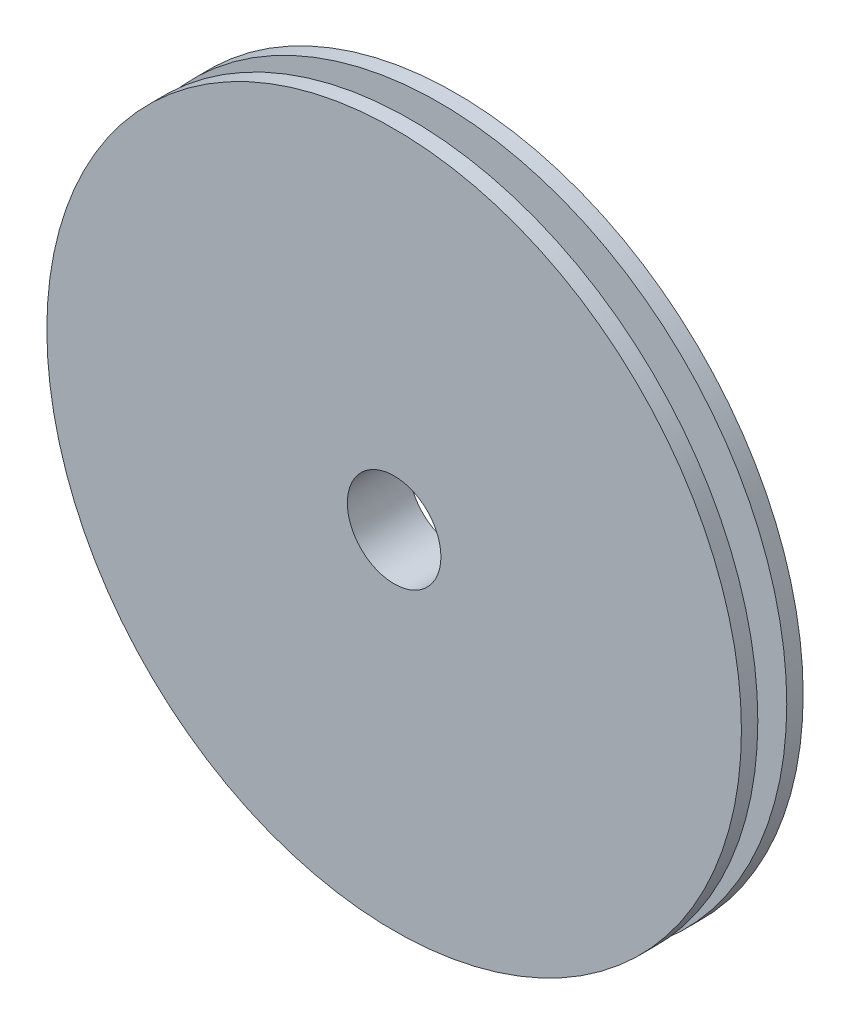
ISO-10303-21;
HEADER;
FILE_DESCRIPTION(('STEP AP214'),'2;1');
FILE_NAME('part.step','',(''),(''),'','','');
FILE_SCHEMA(('AUTOMOTIVE_DESIGN { 1 0 10303 214 1 1 1 1 }'));
ENDSEC;
DATA;
#1=APPLICATION_CONTEXT('core data for automotive mechanical design processes');
#2=APPLICATION_PROTOCOL_DEFINITION('international standard','automotive_design',2000,#1);
#3=PRODUCT_CONTEXT('',#1,'mechanical');
#4=PRODUCT('Part','Part','',(#3));
#5=PRODUCT_RELATED_PRODUCT_CATEGORY('part','',(#4));
#6=PRODUCT_DEFINITION_FORMATION('','',#4);
#7=PRODUCT_DEFINITION_CONTEXT('part definition',#1,'design');
#8=PRODUCT_DEFINITION('design','',#6,#7);
#9=PRODUCT_DEFINITION_SHAPE('','',#8);
#10=(LENGTH_UNIT() NAMED_UNIT(*) SI_UNIT(.MILLI.,.METRE.));
#11=(NAMED_UNIT(*) PLANE_ANGLE_UNIT() SI_UNIT($,.RADIAN.));
#12=(NAMED_UNIT(*) SI_UNIT($,.STERADIAN.) SOLID_ANGLE_UNIT());
#13=UNCERTAINTY_MEASURE_WITH_UNIT(LENGTH_MEASURE(1.E-05),#10,'distance_accuracy_value','');
#14=(GEOMETRIC_REPRESENTATION_CONTEXT(3) GLOBAL_UNCERTAINTY_ASSIGNED_CONTEXT((#13)) GLOBAL_UNIT_ASSIGNED_CONTEXT((#10,
#11,#12)) REPRESENTATION_CONTEXT('',''));
#15=CARTESIAN_POINT('',(0.,0.,0.));
#16=DIRECTION('',(0.,0.,1.));
#17=DIRECTION('',(1.,0.,0.));
#18=AXIS2_PLACEMENT_3D('',#15,#16,#17);
#19=CARTESIAN_POINT('',(0.,0.,3.2));
#20=DIRECTION('',(0.,0.,-1.));
#21=DIRECTION('',(-1.,0.,0.));
#22=AXIS2_PLACEMENT_3D('',#19,#20,#21);
#23=CYLINDRICAL_SURFACE('',#22,18.);
#24=CARTESIAN_POINT('',(0.,0.,0.));
#25=DIRECTION('',(0.,0.,1.));
#26=DIRECTION('',(1.,0.,0.));
#27=AXIS2_PLACEMENT_3D('',#24,#25,#26);
#28=CIRCLE('',#27,18.);
#29=CARTESIAN_POINT('',(18.,0.,0.));
#30=VERTEX_POINT('',#29);
#31=EDGE_CURVE('E48',#30,#30,#28,.T.);
#32=ORIENTED_EDGE('',*,*,#31,.T.);
#33=EDGE_LOOP('',(#32));
#34=FACE_BOUND('',#33,.T.);
#35=CARTESIAN_POINT('',(0.,0.,0.85));
#36=DIRECTION('',(0.,0.,1.));
#37=DIRECTION('',(1.,0.,0.));
#38=AXIS2_PLACEMENT_3D('',#35,#36,#37);
#39=CIRCLE('',#38,18.);
#40=CARTESIAN_POINT('',(18.,0.,0.85));
#41=VERTEX_POINT('',#40);
#42=EDGE_CURVE('E60',#41,#41,#39,.T.);
#43=ORIENTED_EDGE('',*,*,#42,.F.);
#44=EDGE_LOOP('',(#43));
#45=FACE_BOUND('',#44,.T.);
#46=ADVANCED_FACE('F40',(#34,#45),#23,.T.);
#47=CARTESIAN_POINT('',(0.,0.,2.35));
#48=DIRECTION('',(0.,0.,1.));
#49=DIRECTION('',(1.,0.,0.));
#50=AXIS2_PLACEMENT_3D('',#47,#48,#49);
#51=CIRCLE('',#50,18.);
#52=CARTESIAN_POINT('',(18.,0.,2.35));
#53=VERTEX_POINT('',#52);
#54=EDGE_CURVE('E57',#53,#53,#51,.T.);
#55=ORIENTED_EDGE('',*,*,#54,.T.);
#56=EDGE_LOOP('',(#55));
#57=FACE_BOUND('',#56,.T.);
#58=CARTESIAN_POINT('',(0.,0.,3.2));
#59=DIRECTION('',(0.,0.,1.));
#60=DIRECTION('',(1.,0.,0.));
#61=AXIS2_PLACEMENT_3D('',#58,#59,#60);
#62=CIRCLE('',#61,18.);
#63=CARTESIAN_POINT('',(18.,0.,3.2));
#64=VERTEX_POINT('',#63);
#65=EDGE_CURVE('E11',#64,#64,#62,.T.);
#66=ORIENTED_EDGE('',*,*,#65,.F.);
#67=EDGE_LOOP('',(#66));
#68=FACE_BOUND('',#67,.T.);
#69=ADVANCED_FACE('F42',(#57,#68),#23,.T.);
#70=CARTESIAN_POINT('',(0.,0.,3.2));
#71=DIRECTION('',(0.,0.,1.));
#72=DIRECTION('',(1.,0.,0.));
#73=AXIS2_PLACEMENT_3D('',#70,#71,#72);
#74=PLANE('',#73);
#75=CARTESIAN_POINT('',(0.,0.,3.2));
#76=DIRECTION('',(0.,0.,1.));
#77=DIRECTION('',(1.,0.,0.));
#78=AXIS2_PLACEMENT_3D('',#75,#76,#77);
#79=CIRCLE('',#78,2.425);
#80=CARTESIAN_POINT('',(2.425,0.,3.2));
#81=VERTEX_POINT('',#80);
#82=EDGE_CURVE('E53',#81,#81,#79,.F.);
#83=ORIENTED_EDGE('',*,*,#82,.T.);
#84=EDGE_LOOP('',(#83));
#85=FACE_BOUND('',#84,.T.);
#86=ORIENTED_EDGE('',*,*,#65,.T.);
#87=EDGE_LOOP('',(#86));
#88=FACE_BOUND('',#87,.T.);
#89=ADVANCED_FACE('F86',(#85,#88),#74,.T.);
#90=CARTESIAN_POINT('',(0.,0.,0.));
#91=DIRECTION('',(0.,0.,1.));
#92=DIRECTION('',(1.,0.,0.));
#93=AXIS2_PLACEMENT_3D('',#90,#91,#92);
#94=PLANE('',#93);
#95=CARTESIAN_POINT('',(0.,0.,0.));
#96=DIRECTION('',(0.,0.,1.));
#97=DIRECTION('',(1.,0.,0.));
#98=AXIS2_PLACEMENT_3D('',#95,#96,#97);
#99=CIRCLE('',#98,2.425);
#100=CARTESIAN_POINT('',(2.425,0.,0.));
#101=VERTEX_POINT('',#100);
#102=EDGE_CURVE('E44',#101,#101,#99,.F.);
#103=ORIENTED_EDGE('',*,*,#102,.F.);
#104=EDGE_LOOP('',(#103));
#105=FACE_BOUND('',#104,.T.);
#106=ORIENTED_EDGE('',*,*,#31,.F.);
#107=EDGE_LOOP('',(#106));
#108=FACE_BOUND('',#107,.T.);
#109=ADVANCED_FACE('F90',(#105,#108),#94,.F.);
#110=CARTESIAN_POINT('',(0.,0.,20.2));
#111=DIRECTION('',(0.,0.,-1.));
#112=DIRECTION('',(-1.,0.,0.));
#113=AXIS2_PLACEMENT_3D('',#110,#111,#112);
#114=CYLINDRICAL_SURFACE('',#113,2.425);
#115=ORIENTED_EDGE('',*,*,#82,.F.);
#116=EDGE_LOOP('',(#115));
#117=FACE_BOUND('',#116,.T.);
#118=ORIENTED_EDGE('',*,*,#102,.T.);
#119=EDGE_LOOP('',(#118));
#120=FACE_BOUND('',#119,.T.);
#121=ADVANCED_FACE('F77',(#117,#120),#114,.F.);
#122=CARTESIAN_POINT('',(0.,0.,0.85));
#123=DIRECTION('',(0.,0.,1.));
#124=DIRECTION('',(1.,0.,0.));
#125=AXIS2_PLACEMENT_3D('',#122,#123,#124);
#126=PLANE('',#125);
#127=CARTESIAN_POINT('',(0.,0.,0.85));
#128=DIRECTION('',(0.,0.,1.));
#129=DIRECTION('',(1.,0.,0.));
#130=AXIS2_PLACEMENT_3D('',#127,#128,#129);
#131=CIRCLE('',#130,15.5);
#132=CARTESIAN_POINT('',(15.5,0.,0.85));
#133=VERTEX_POINT('',#132);
#134=EDGE_CURVE('E61',#133,#133,#131,.T.);
#135=ORIENTED_EDGE('',*,*,#134,.F.);
#136=EDGE_LOOP('',(#135));
#137=FACE_BOUND('',#136,.T.);
#138=ORIENTED_EDGE('',*,*,#42,.T.);
#139=EDGE_LOOP('',(#138));
#140=FACE_BOUND('',#139,.T.);
#141=ADVANCED_FACE('F73',(#137,#140),#126,.T.);
#142=CARTESIAN_POINT('',(0.,0.,2.35));
#143=DIRECTION('',(0.,0.,1.));
#144=DIRECTION('',(1.,0.,0.));
#145=AXIS2_PLACEMENT_3D('',#142,#143,#144);
#146=PLANE('',#145);
#147=CARTESIAN_POINT('',(0.,0.,2.35));
#148=DIRECTION('',(0.,0.,1.));
#149=DIRECTION('',(1.,0.,0.));
#150=AXIS2_PLACEMENT_3D('',#147,#148,#149);
#151=CIRCLE('',#150,15.5);
#152=CARTESIAN_POINT('',(15.5,0.,2.35));
#153=VERTEX_POINT('',#152);
#154=EDGE_CURVE('E64',#153,#153,#151,.T.);
#155=ORIENTED_EDGE('',*,*,#154,.T.);
#156=EDGE_LOOP('',(#155));
#157=FACE_BOUND('',#156,.T.);
#158=ORIENTED_EDGE('',*,*,#54,.F.);
#159=EDGE_LOOP('',(#158));
#160=FACE_BOUND('',#159,.T.);
#161=ADVANCED_FACE('F76',(#157,#160),#146,.F.);
#162=CARTESIAN_POINT('',(0.,0.,0.85));
#163=DIRECTION('',(0.,0.,1.));
#164=DIRECTION('',(1.,0.,0.));
#165=AXIS2_PLACEMENT_3D('',#162,#163,#164);
#166=CYLINDRICAL_SURFACE('',#165,15.5);
#167=ORIENTED_EDGE('',*,*,#134,.T.);
#168=EDGE_LOOP('',(#167));
#169=FACE_BOUND('',#168,.T.);
#170=ORIENTED_EDGE('',*,*,#154,.F.);
#171=EDGE_LOOP('',(#170));
#172=FACE_BOUND('',#171,.T.);
#173=ADVANCED_FACE('F70',(#169,#172),#166,.T.);
#174=CLOSED_SHELL('',(#46,#69,#89,#109,#121,#141,#161,#173));
#175=MANIFOLD_SOLID_BREP('B2',#174);
#176=ADVANCED_BREP_SHAPE_REPRESENTATION('',(#18,#175),#14);
#177=SHAPE_DEFINITION_REPRESENTATION(#9,#176);
ENDSEC;
END-ISO-10303-21;
